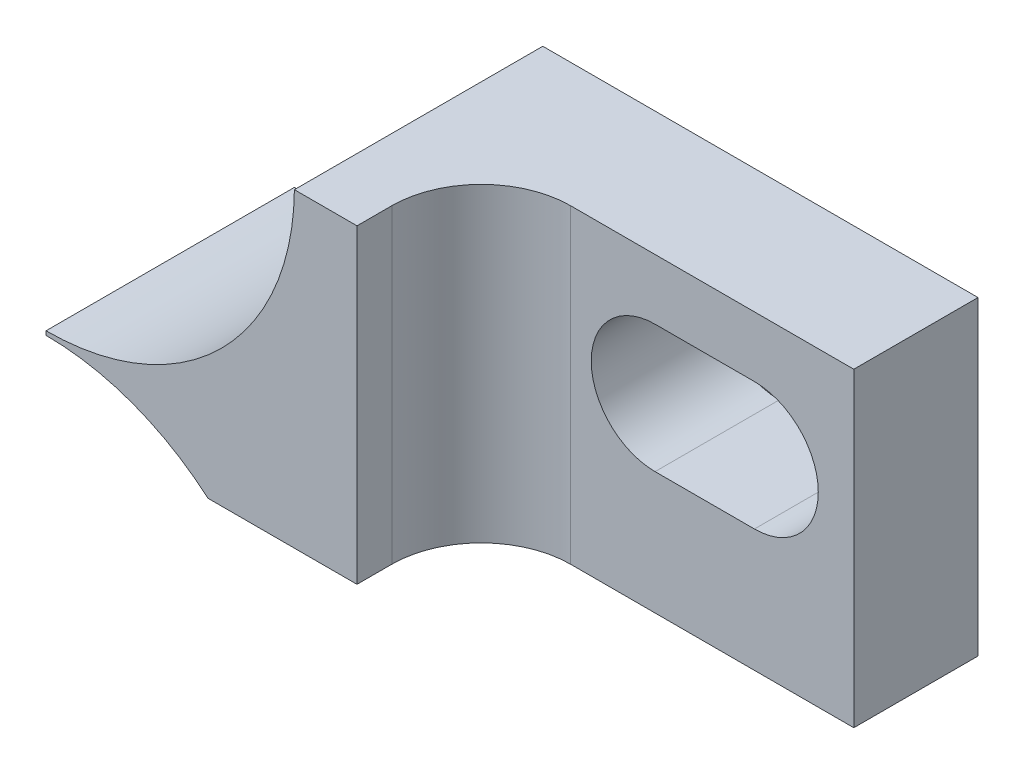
ISO-10303-21;
HEADER;
FILE_DESCRIPTION(('STEP AP214'),'2;1');
FILE_NAME('part.step','',(''),(''),'','','');
FILE_SCHEMA(('AUTOMOTIVE_DESIGN { 1 0 10303 214 1 1 1 1 }'));
ENDSEC;
DATA;
#1=APPLICATION_CONTEXT('core data for automotive mechanical design processes');
#2=APPLICATION_PROTOCOL_DEFINITION('international standard','automotive_design',2000,#1);
#3=PRODUCT_CONTEXT('',#1,'mechanical');
#4=PRODUCT('Part','Part','',(#3));
#5=PRODUCT_RELATED_PRODUCT_CATEGORY('part','',(#4));
#6=PRODUCT_DEFINITION_FORMATION('','',#4);
#7=PRODUCT_DEFINITION_CONTEXT('part definition',#1,'design');
#8=PRODUCT_DEFINITION('design','',#6,#7);
#9=PRODUCT_DEFINITION_SHAPE('','',#8);
#10=(LENGTH_UNIT() NAMED_UNIT(*) SI_UNIT(.MILLI.,.METRE.));
#11=(NAMED_UNIT(*) PLANE_ANGLE_UNIT() SI_UNIT($,.RADIAN.));
#12=(NAMED_UNIT(*) SI_UNIT($,.STERADIAN.) SOLID_ANGLE_UNIT());
#13=UNCERTAINTY_MEASURE_WITH_UNIT(LENGTH_MEASURE(1.E-05),#10,'distance_accuracy_value','');
#14=(GEOMETRIC_REPRESENTATION_CONTEXT(3) GLOBAL_UNCERTAINTY_ASSIGNED_CONTEXT((#13)) GLOBAL_UNIT_ASSIGNED_CONTEXT((#10,
#11,#12)) REPRESENTATION_CONTEXT('',''));
#15=CARTESIAN_POINT('',(0.,0.,0.));
#16=DIRECTION('',(0.,0.,1.));
#17=DIRECTION('',(1.,0.,0.));
#18=AXIS2_PLACEMENT_3D('',#15,#16,#17);
#19=CARTESIAN_POINT('',(96.8248,-0.0508000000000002,6.35));
#20=DIRECTION('',(0.,0.,-1.));
#21=DIRECTION('',(-1.,0.,0.));
#22=AXIS2_PLACEMENT_3D('',#19,#20,#21);
#23=CYLINDRICAL_SURFACE('',#22,6.35);
#24=DIRECTION('',(0.,0.,-1.));
#25=VECTOR('',#24,1.);
#26=CARTESIAN_POINT('',(96.8248,6.2992,6.35));
#27=LINE('',#26,#25);
#28=CARTESIAN_POINT('',(96.8248,6.2992,0.));
#29=VERTEX_POINT('',#28);
#30=CARTESIAN_POINT('',(96.8248,6.2992,6.35));
#31=VERTEX_POINT('',#30);
#32=EDGE_CURVE('E128',#29,#31,#27,.F.);
#33=ORIENTED_EDGE('',*,*,#32,.F.);
#34=CARTESIAN_POINT('',(96.8248,-0.0508000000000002,0.));
#35=DIRECTION('',(0.,0.,-1.));
#36=DIRECTION('',(-1.,0.,0.));
#37=AXIS2_PLACEMENT_3D('',#34,#35,#36);
#38=CIRCLE('',#37,6.35);
#39=CARTESIAN_POINT('',(100.966616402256,4.7625,0.));
#40=VERTEX_POINT('',#39);
#41=EDGE_CURVE('E139',#29,#40,#38,.T.);
#42=ORIENTED_EDGE('',*,*,#41,.T.);
#43=DIRECTION('',(0.,0.,-1.));
#44=VECTOR('',#43,1.);
#45=CARTESIAN_POINT('',(100.966616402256,4.7625,6.35));
#46=LINE('',#45,#44);
#47=CARTESIAN_POINT('',(100.966616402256,4.7625,6.35));
#48=VERTEX_POINT('',#47);
#49=EDGE_CURVE('E148',#40,#48,#46,.F.);
#50=ORIENTED_EDGE('',*,*,#49,.T.);
#51=CARTESIAN_POINT('',(96.8248,-0.0508000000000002,6.35));
#52=DIRECTION('',(0.,0.,-1.));
#53=DIRECTION('',(-1.,0.,0.));
#54=AXIS2_PLACEMENT_3D('',#51,#52,#53);
#55=CIRCLE('',#54,6.35);
#56=EDGE_CURVE('E141',#31,#48,#55,.T.);
#57=ORIENTED_EDGE('',*,*,#56,.F.);
#58=EDGE_LOOP('',(#33,#42,#50,#57));
#59=FACE_BOUND('',#58,.T.);
#60=ADVANCED_FACE('F34',(#59),#23,.F.);
#61=CARTESIAN_POINT('',(96.8248,12.7508,6.35));
#62=DIRECTION('',(0.,0.,-1.));
#63=DIRECTION('',(-1.,0.,0.));
#64=AXIS2_PLACEMENT_3D('',#61,#62,#63);
#65=CYLINDRICAL_SURFACE('',#64,6.35);
#66=DIRECTION('',(0.,0.,-1.));
#67=VECTOR('',#66,1.);
#68=CARTESIAN_POINT('',(96.8248,6.4008,6.35));
#69=LINE('',#68,#67);
#70=CARTESIAN_POINT('',(96.8248,6.4008,6.35));
#71=VERTEX_POINT('',#70);
#72=CARTESIAN_POINT('',(96.8248,6.4008,0.));
#73=VERTEX_POINT('',#72);
#74=EDGE_CURVE('E48',#71,#73,#69,.T.);
#75=ORIENTED_EDGE('',*,*,#74,.F.);
#76=CARTESIAN_POINT('',(96.8248,12.7508,6.35));
#77=DIRECTION('',(0.,0.,-1.));
#78=DIRECTION('',(-1.,0.,0.));
#79=AXIS2_PLACEMENT_3D('',#76,#77,#78);
#80=CIRCLE('',#79,6.35);
#81=CARTESIAN_POINT('',(103.174596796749,12.7,6.35));
#82=VERTEX_POINT('',#81);
#83=EDGE_CURVE('E156',#82,#71,#80,.T.);
#84=ORIENTED_EDGE('',*,*,#83,.F.);
#85=DIRECTION('',(0.,0.,-1.));
#86=VECTOR('',#85,1.);
#87=CARTESIAN_POINT('',(103.174596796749,12.7,6.35));
#88=LINE('',#87,#86);
#89=CARTESIAN_POINT('',(103.174596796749,12.7,0.));
#90=VERTEX_POINT('',#89);
#91=EDGE_CURVE('E183',#82,#90,#88,.T.);
#92=ORIENTED_EDGE('',*,*,#91,.T.);
#93=CARTESIAN_POINT('',(96.8248,12.7508,0.));
#94=DIRECTION('',(0.,0.,-1.));
#95=DIRECTION('',(-1.,0.,0.));
#96=AXIS2_PLACEMENT_3D('',#93,#94,#95);
#97=CIRCLE('',#96,6.35);
#98=EDGE_CURVE('E161',#90,#73,#97,.T.);
#99=ORIENTED_EDGE('',*,*,#98,.T.);
#100=EDGE_LOOP('',(#75,#84,#92,#99));
#101=FACE_BOUND('',#100,.T.);
#102=ADVANCED_FACE('F197',(#101),#65,.F.);
#103=CARTESIAN_POINT('',(-32.4430669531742,6.35000000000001,6.35));
#104=DIRECTION('',(0.,0.,-1.));
#105=DIRECTION('',(-1.,0.,0.));
#106=AXIS2_PLACEMENT_3D('',#103,#104,#105);
#107=PLANE('',#106);
#108=DIRECTION('',(0.,1.,0.));
#109=VECTOR('',#108,1.);
#110=CARTESIAN_POINT('',(96.8248,6.34999999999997,6.35));
#111=LINE('',#110,#109);
#112=EDGE_CURVE('E134',#31,#71,#111,.T.);
#113=ORIENTED_EDGE('',*,*,#112,.F.);
#114=ORIENTED_EDGE('',*,*,#56,.T.);
#115=DIRECTION('',(1.,0.,0.));
#116=VECTOR('',#115,1.);
#117=CARTESIAN_POINT('',(114.3,4.7625,6.35));
#118=LINE('',#117,#116);
#119=CARTESIAN_POINT('',(104.775,4.7625,6.35));
#120=VERTEX_POINT('',#119);
#121=EDGE_CURVE('E210',#48,#120,#118,.T.);
#122=ORIENTED_EDGE('',*,*,#121,.T.);
#123=DIRECTION('',(0.,-1.,0.));
#124=VECTOR('',#123,1.);
#125=CARTESIAN_POINT('',(104.775,12.7,6.35));
#126=LINE('',#125,#124);
#127=CARTESIAN_POINT('',(104.775,12.7,6.35));
#128=VERTEX_POINT('',#127);
#129=EDGE_CURVE('E223',#128,#120,#126,.T.);
#130=ORIENTED_EDGE('',*,*,#129,.F.);
#131=DIRECTION('',(1.,0.,0.));
#132=VECTOR('',#131,1.);
#133=CARTESIAN_POINT('',(-32.4430669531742,12.7,6.35));
#134=LINE('',#133,#132);
#135=EDGE_CURVE('E203',#82,#128,#134,.T.);
#136=ORIENTED_EDGE('',*,*,#135,.F.);
#137=ORIENTED_EDGE('',*,*,#83,.T.);
#138=EDGE_LOOP('',(#113,#114,#122,#130,#136,#137));
#139=FACE_BOUND('',#138,.T.);
#140=ADVANCED_FACE('F242',(#139),#107,.F.);
#141=CARTESIAN_POINT('',(-32.4430669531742,6.35000000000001,0.));
#142=DIRECTION('',(0.,0.,-1.));
#143=DIRECTION('',(-1.,0.,0.));
#144=AXIS2_PLACEMENT_3D('',#141,#142,#143);
#145=PLANE('',#144);
#146=DIRECTION('',(-1.,0.,0.));
#147=VECTOR('',#146,1.);
#148=CARTESIAN_POINT('',(-32.4430669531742,7.89304999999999,0.));
#149=LINE('',#148,#147);
#150=CARTESIAN_POINT('',(111.76,7.89304999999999,0.));
#151=VERTEX_POINT('',#150);
#152=CARTESIAN_POINT('',(109.22,7.89304999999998,0.));
#153=VERTEX_POINT('',#152);
#154=EDGE_CURVE('E163',#151,#153,#149,.T.);
#155=ORIENTED_EDGE('',*,*,#154,.F.);
#156=CARTESIAN_POINT('',(111.76,9.525,0.));
#157=DIRECTION('',(0.,0.,-1.));
#158=DIRECTION('',(-1.,0.,0.));
#159=AXIS2_PLACEMENT_3D('',#156,#157,#158);
#160=CIRCLE('',#159,1.63195);
#161=CARTESIAN_POINT('',(111.76,11.15695,0.));
#162=VERTEX_POINT('',#161);
#163=EDGE_CURVE('E172',#162,#151,#160,.T.);
#164=ORIENTED_EDGE('',*,*,#163,.F.);
#165=DIRECTION('',(1.,0.,0.));
#166=VECTOR('',#165,1.);
#167=CARTESIAN_POINT('',(-32.4430669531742,11.1569499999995,0.));
#168=LINE('',#167,#166);
#169=CARTESIAN_POINT('',(109.22,11.15695,0.));
#170=VERTEX_POINT('',#169);
#171=EDGE_CURVE('E169',#170,#162,#168,.T.);
#172=ORIENTED_EDGE('',*,*,#171,.F.);
#173=CARTESIAN_POINT('',(109.22,9.52499999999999,0.));
#174=DIRECTION('',(0.,0.,-1.));
#175=DIRECTION('',(-1.,0.,0.));
#176=AXIS2_PLACEMENT_3D('',#173,#174,#175);
#177=CIRCLE('',#176,1.63195);
#178=EDGE_CURVE('E166',#153,#170,#177,.T.);
#179=ORIENTED_EDGE('',*,*,#178,.F.);
#180=EDGE_LOOP('',(#155,#164,#172,#179));
#181=FACE_BOUND('',#180,.T.);
#182=ORIENTED_EDGE('',*,*,#41,.F.);
#183=DIRECTION('',(0.,1.,0.));
#184=VECTOR('',#183,1.);
#185=CARTESIAN_POINT('',(96.8248,19.9842856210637,0.));
#186=LINE('',#185,#184);
#187=EDGE_CURVE('E125',#29,#73,#186,.T.);
#188=ORIENTED_EDGE('',*,*,#187,.T.);
#189=ORIENTED_EDGE('',*,*,#98,.F.);
#190=DIRECTION('',(1.,0.,0.));
#191=VECTOR('',#190,1.);
#192=CARTESIAN_POINT('',(-32.4430669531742,12.7,0.));
#193=LINE('',#192,#191);
#194=CARTESIAN_POINT('',(114.3,12.7,0.));
#195=VERTEX_POINT('',#194);
#196=EDGE_CURVE('E151',#90,#195,#193,.T.);
#197=ORIENTED_EDGE('',*,*,#196,.T.);
#198=DIRECTION('',(0.,1.,0.));
#199=VECTOR('',#198,1.);
#200=CARTESIAN_POINT('',(114.3,6.35000000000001,0.));
#201=LINE('',#200,#199);
#202=CARTESIAN_POINT('',(114.3,4.7625,0.));
#203=VERTEX_POINT('',#202);
#204=EDGE_CURVE('E147',#203,#195,#201,.T.);
#205=ORIENTED_EDGE('',*,*,#204,.F.);
#206=DIRECTION('',(1.,0.,0.));
#207=VECTOR('',#206,1.);
#208=CARTESIAN_POINT('',(-32.4430669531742,4.7625,0.));
#209=LINE('',#208,#207);
#210=EDGE_CURVE('E11',#40,#203,#209,.T.);
#211=ORIENTED_EDGE('',*,*,#210,.F.);
#212=EDGE_LOOP('',(#182,#188,#189,#197,#205,#211));
#213=FACE_BOUND('',#212,.T.);
#214=ADVANCED_FACE('F145',(#181,#213),#145,.T.);
#215=CARTESIAN_POINT('',(-32.4430669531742,7.89304999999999,6.35));
#216=DIRECTION('',(0.,-1.,0.));
#217=DIRECTION('',(0.,0.,-1.));
#218=AXIS2_PLACEMENT_3D('',#215,#216,#217);
#219=PLANE('',#218);
#220=DIRECTION('',(0.,0.,-1.));
#221=VECTOR('',#220,1.);
#222=CARTESIAN_POINT('',(109.22,7.89304999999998,6.35));
#223=LINE('',#222,#221);
#224=CARTESIAN_POINT('',(109.22,7.89304999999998,3.175));
#225=VERTEX_POINT('',#224);
#226=EDGE_CURVE('E41',#225,#153,#223,.T.);
#227=ORIENTED_EDGE('',*,*,#226,.F.);
#228=DIRECTION('',(1.,0.,0.));
#229=VECTOR('',#228,1.);
#230=CARTESIAN_POINT('',(-32.4430669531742,7.89304999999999,3.17499999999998));
#231=LINE('',#230,#229);
#232=CARTESIAN_POINT('',(111.76,7.89304999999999,3.175));
#233=VERTEX_POINT('',#232);
#234=EDGE_CURVE('E213',#225,#233,#231,.T.);
#235=ORIENTED_EDGE('',*,*,#234,.T.);
#236=DIRECTION('',(0.,0.,-1.));
#237=VECTOR('',#236,1.);
#238=CARTESIAN_POINT('',(111.76,7.89304999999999,6.35));
#239=LINE('',#238,#237);
#240=EDGE_CURVE('E175',#233,#151,#239,.T.);
#241=ORIENTED_EDGE('',*,*,#240,.T.);
#242=ORIENTED_EDGE('',*,*,#154,.T.);
#243=EDGE_LOOP('',(#227,#235,#241,#242));
#244=FACE_BOUND('',#243,.T.);
#245=ADVANCED_FACE('F274',(#244),#219,.F.);
#246=CARTESIAN_POINT('',(109.22,9.52499999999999,6.35));
#247=DIRECTION('',(0.,0.,-1.));
#248=DIRECTION('',(-1.,0.,0.));
#249=AXIS2_PLACEMENT_3D('',#246,#247,#248);
#250=CYLINDRICAL_SURFACE('',#249,1.63195);
#251=DIRECTION('',(0.,0.,-1.));
#252=VECTOR('',#251,1.);
#253=CARTESIAN_POINT('',(109.22,11.15695,6.35));
#254=LINE('',#253,#252);
#255=CARTESIAN_POINT('',(109.22,11.15695,3.175));
#256=VERTEX_POINT('',#255);
#257=EDGE_CURVE('E180',#256,#170,#254,.T.);
#258=ORIENTED_EDGE('',*,*,#257,.F.);
#259=CARTESIAN_POINT('',(109.22,9.52499999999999,3.175));
#260=DIRECTION('',(0.,0.,-1.));
#261=DIRECTION('',(-1.,0.,0.));
#262=AXIS2_PLACEMENT_3D('',#259,#260,#261);
#263=CIRCLE('',#262,1.63195);
#264=EDGE_CURVE('E216',#256,#225,#263,.F.);
#265=ORIENTED_EDGE('',*,*,#264,.T.);
#266=ORIENTED_EDGE('',*,*,#226,.T.);
#267=ORIENTED_EDGE('',*,*,#178,.T.);
#268=EDGE_LOOP('',(#258,#265,#266,#267));
#269=FACE_BOUND('',#268,.T.);
#270=ADVANCED_FACE('F264',(#269),#250,.F.);
#271=CARTESIAN_POINT('',(-32.4430669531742,11.1569499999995,6.35));
#272=DIRECTION('',(0.,1.,0.));
#273=DIRECTION('',(-1.,0.,0.));
#274=AXIS2_PLACEMENT_3D('',#271,#272,#273);
#275=PLANE('',#274);
#276=DIRECTION('',(0.,0.,-1.));
#277=VECTOR('',#276,1.);
#278=CARTESIAN_POINT('',(111.76,11.15695,6.35));
#279=LINE('',#278,#277);
#280=CARTESIAN_POINT('',(111.76,11.15695,3.175));
#281=VERTEX_POINT('',#280);
#282=EDGE_CURVE('E177',#281,#162,#279,.T.);
#283=ORIENTED_EDGE('',*,*,#282,.F.);
#284=DIRECTION('',(-1.,0.,0.));
#285=VECTOR('',#284,1.);
#286=CARTESIAN_POINT('',(-32.4430669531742,11.1569499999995,3.17499999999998));
#287=LINE('',#286,#285);
#288=EDGE_CURVE('E56',#281,#256,#287,.T.);
#289=ORIENTED_EDGE('',*,*,#288,.T.);
#290=ORIENTED_EDGE('',*,*,#257,.T.);
#291=ORIENTED_EDGE('',*,*,#171,.T.);
#292=EDGE_LOOP('',(#283,#289,#290,#291));
#293=FACE_BOUND('',#292,.T.);
#294=ADVANCED_FACE('F263',(#293),#275,.F.);
#295=CARTESIAN_POINT('',(114.3,6.35000000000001,6.35));
#296=DIRECTION('',(-1.,0.,0.));
#297=DIRECTION('',(0.,0.,1.));
#298=AXIS2_PLACEMENT_3D('',#295,#296,#297);
#299=PLANE('',#298);
#300=DIRECTION('',(0.,0.,-1.));
#301=VECTOR('',#300,1.);
#302=CARTESIAN_POINT('',(114.3,12.7,6.35));
#303=LINE('',#302,#301);
#304=CARTESIAN_POINT('',(114.3,12.7,3.175));
#305=VERTEX_POINT('',#304);
#306=EDGE_CURVE('E178',#305,#195,#303,.T.);
#307=ORIENTED_EDGE('',*,*,#306,.F.);
#308=DIRECTION('',(0.,-1.,0.));
#309=VECTOR('',#308,1.);
#310=CARTESIAN_POINT('',(114.3,12.7,3.175));
#311=LINE('',#310,#309);
#312=CARTESIAN_POINT('',(114.3,4.7625,3.175));
#313=VERTEX_POINT('',#312);
#314=EDGE_CURVE('E222',#305,#313,#311,.T.);
#315=ORIENTED_EDGE('',*,*,#314,.T.);
#316=DIRECTION('',(0.,0.,-1.));
#317=VECTOR('',#316,1.);
#318=CARTESIAN_POINT('',(114.3,4.7625,6.35));
#319=LINE('',#318,#317);
#320=EDGE_CURVE('E153',#313,#203,#319,.T.);
#321=ORIENTED_EDGE('',*,*,#320,.T.);
#322=ORIENTED_EDGE('',*,*,#204,.T.);
#323=EDGE_LOOP('',(#307,#315,#321,#322));
#324=FACE_BOUND('',#323,.T.);
#325=ADVANCED_FACE('F194',(#324),#299,.F.);
#326=CARTESIAN_POINT('',(-32.4430669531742,12.7,6.35));
#327=DIRECTION('',(0.,1.,0.));
#328=DIRECTION('',(0.,0.,1.));
#329=AXIS2_PLACEMENT_3D('',#326,#327,#328);
#330=PLANE('',#329);
#331=DIRECTION('',(1.,0.,0.));
#332=VECTOR('',#331,1.);
#333=CARTESIAN_POINT('',(114.3,12.7,3.175));
#334=LINE('',#333,#332);
#335=CARTESIAN_POINT('',(107.061,12.7,3.175));
#336=VERTEX_POINT('',#335);
#337=EDGE_CURVE('E191',#336,#305,#334,.T.);
#338=ORIENTED_EDGE('',*,*,#337,.T.);
#339=ORIENTED_EDGE('',*,*,#306,.T.);
#340=ORIENTED_EDGE('',*,*,#196,.F.);
#341=ORIENTED_EDGE('',*,*,#91,.F.);
#342=ORIENTED_EDGE('',*,*,#135,.T.);
#343=DIRECTION('',(0.,0.,-1.));
#344=VECTOR('',#343,1.);
#345=CARTESIAN_POINT('',(104.775,12.7,6.35));
#346=LINE('',#345,#344);
#347=CARTESIAN_POINT('',(104.775,12.7,5.461));
#348=VERTEX_POINT('',#347);
#349=EDGE_CURVE('E204',#128,#348,#346,.T.);
#350=ORIENTED_EDGE('',*,*,#349,.T.);
#351=CARTESIAN_POINT('',(107.061,12.7,5.461));
#352=DIRECTION('',(0.,-1.,0.));
#353=DIRECTION('',(0.,0.,1.));
#354=AXIS2_PLACEMENT_3D('',#351,#352,#353);
#355=CIRCLE('',#354,2.286);
#356=EDGE_CURVE('E238',#348,#336,#355,.T.);
#357=ORIENTED_EDGE('',*,*,#356,.T.);
#358=EDGE_LOOP('',(#338,#339,#340,#341,#342,#350,#357));
#359=FACE_BOUND('',#358,.T.);
#360=ADVANCED_FACE('F188',(#359),#330,.T.);
#361=CARTESIAN_POINT('',(111.76,9.525,6.35));
#362=DIRECTION('',(0.,0.,-1.));
#363=DIRECTION('',(-1.,0.,0.));
#364=AXIS2_PLACEMENT_3D('',#361,#362,#363);
#365=CYLINDRICAL_SURFACE('',#364,1.63195);
#366=ORIENTED_EDGE('',*,*,#240,.F.);
#367=CARTESIAN_POINT('',(111.76,9.525,3.175));
#368=DIRECTION('',(0.,0.,-1.));
#369=DIRECTION('',(-1.,0.,0.));
#370=AXIS2_PLACEMENT_3D('',#367,#368,#369);
#371=CIRCLE('',#370,1.63195);
#372=EDGE_CURVE('E220',#233,#281,#371,.F.);
#373=ORIENTED_EDGE('',*,*,#372,.T.);
#374=ORIENTED_EDGE('',*,*,#282,.T.);
#375=ORIENTED_EDGE('',*,*,#163,.T.);
#376=EDGE_LOOP('',(#366,#373,#374,#375));
#377=FACE_BOUND('',#376,.T.);
#378=ADVANCED_FACE('F272',(#377),#365,.F.);
#379=CARTESIAN_POINT('',(114.3,4.7625,6.35));
#380=DIRECTION('',(0.,1.,0.));
#381=DIRECTION('',(0.,0.,1.));
#382=AXIS2_PLACEMENT_3D('',#379,#380,#381);
#383=PLANE('',#382);
#384=ORIENTED_EDGE('',*,*,#320,.F.);
#385=DIRECTION('',(1.,0.,0.));
#386=VECTOR('',#385,1.);
#387=CARTESIAN_POINT('',(114.3,4.7625,3.175));
#388=LINE('',#387,#386);
#389=CARTESIAN_POINT('',(107.061,4.7625,3.175));
#390=VERTEX_POINT('',#389);
#391=EDGE_CURVE('E230',#390,#313,#388,.T.);
#392=ORIENTED_EDGE('',*,*,#391,.F.);
#393=CARTESIAN_POINT('',(107.061,4.7625,5.461));
#394=DIRECTION('',(0.,-1.,0.));
#395=DIRECTION('',(0.,0.,1.));
#396=AXIS2_PLACEMENT_3D('',#393,#394,#395);
#397=CIRCLE('',#396,2.286);
#398=CARTESIAN_POINT('',(104.775,4.7625,5.461));
#399=VERTEX_POINT('',#398);
#400=EDGE_CURVE('E232',#399,#390,#397,.T.);
#401=ORIENTED_EDGE('',*,*,#400,.F.);
#402=DIRECTION('',(0.,0.,-1.));
#403=VECTOR('',#402,1.);
#404=CARTESIAN_POINT('',(104.775,4.7625,6.35));
#405=LINE('',#404,#403);
#406=EDGE_CURVE('E142',#120,#399,#405,.T.);
#407=ORIENTED_EDGE('',*,*,#406,.F.);
#408=ORIENTED_EDGE('',*,*,#121,.F.);
#409=ORIENTED_EDGE('',*,*,#49,.F.);
#410=ORIENTED_EDGE('',*,*,#210,.T.);
#411=EDGE_LOOP('',(#384,#392,#401,#407,#408,#409,#410));
#412=FACE_BOUND('',#411,.T.);
#413=ADVANCED_FACE('F246',(#412),#383,.F.);
#414=CARTESIAN_POINT('',(114.3,12.7,3.175));
#415=DIRECTION('',(0.,0.,-1.));
#416=DIRECTION('',(-1.,0.,0.));
#417=AXIS2_PLACEMENT_3D('',#414,#415,#416);
#418=PLANE('',#417);
#419=ORIENTED_EDGE('',*,*,#391,.T.);
#420=ORIENTED_EDGE('',*,*,#314,.F.);
#421=ORIENTED_EDGE('',*,*,#337,.F.);
#422=DIRECTION('',(0.,-1.,0.));
#423=VECTOR('',#422,1.);
#424=CARTESIAN_POINT('',(107.061,12.7,3.175));
#425=LINE('',#424,#423);
#426=EDGE_CURVE('E227',#336,#390,#425,.T.);
#427=ORIENTED_EDGE('',*,*,#426,.T.);
#428=EDGE_LOOP('',(#419,#420,#421,#427));
#429=FACE_BOUND('',#428,.T.);
#430=ORIENTED_EDGE('',*,*,#264,.F.);
#431=ORIENTED_EDGE('',*,*,#288,.F.);
#432=ORIENTED_EDGE('',*,*,#372,.F.);
#433=ORIENTED_EDGE('',*,*,#234,.F.);
#434=EDGE_LOOP('',(#430,#431,#432,#433));
#435=FACE_BOUND('',#434,.T.);
#436=ADVANCED_FACE('F255',(#429,#435),#418,.F.);
#437=CARTESIAN_POINT('',(107.061,12.7,5.461));
#438=DIRECTION('',(0.,-1.,0.));
#439=DIRECTION('',(0.,0.,-1.));
#440=AXIS2_PLACEMENT_3D('',#437,#438,#439);
#441=CYLINDRICAL_SURFACE('',#440,2.286);
#442=ORIENTED_EDGE('',*,*,#400,.T.);
#443=ORIENTED_EDGE('',*,*,#426,.F.);
#444=ORIENTED_EDGE('',*,*,#356,.F.);
#445=DIRECTION('',(0.,-1.,0.));
#446=VECTOR('',#445,1.);
#447=CARTESIAN_POINT('',(104.775,12.7,5.461));
#448=LINE('',#447,#446);
#449=EDGE_CURVE('E225',#348,#399,#448,.T.);
#450=ORIENTED_EDGE('',*,*,#449,.T.);
#451=EDGE_LOOP('',(#442,#443,#444,#450));
#452=FACE_BOUND('',#451,.T.);
#453=ADVANCED_FACE('F253',(#452),#441,.F.);
#454=CARTESIAN_POINT('',(104.775,12.7,6.35));
#455=DIRECTION('',(-1.,0.,0.));
#456=DIRECTION('',(0.,0.,1.));
#457=AXIS2_PLACEMENT_3D('',#454,#455,#456);
#458=PLANE('',#457);
#459=ORIENTED_EDGE('',*,*,#406,.T.);
#460=ORIENTED_EDGE('',*,*,#449,.F.);
#461=ORIENTED_EDGE('',*,*,#349,.F.);
#462=ORIENTED_EDGE('',*,*,#129,.T.);
#463=EDGE_LOOP('',(#459,#460,#461,#462));
#464=FACE_BOUND('',#463,.T.);
#465=ADVANCED_FACE('F250',(#464),#458,.F.);
#466=CARTESIAN_POINT('',(96.8248,19.9842856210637,8.89));
#467=DIRECTION('',(-1.,0.,0.));
#468=DIRECTION('',(0.,-1.,0.));
#469=AXIS2_PLACEMENT_3D('',#466,#467,#468);
#470=PLANE('',#469);
#471=ORIENTED_EDGE('',*,*,#32,.T.);
#472=ORIENTED_EDGE('',*,*,#112,.T.);
#473=ORIENTED_EDGE('',*,*,#74,.T.);
#474=ORIENTED_EDGE('',*,*,#187,.F.);
#475=EDGE_LOOP('',(#471,#472,#473,#474));
#476=FACE_BOUND('',#475,.T.);
#477=ADVANCED_FACE('F127',(#476),#470,.T.);
#478=CLOSED_SHELL('',(#60,#102,#140,#214,#245,#270,#294,#325,#360,#378,#413,#436,#453,#465,#477));
#479=MANIFOLD_SOLID_BREP('B2',#478);
#480=ADVANCED_BREP_SHAPE_REPRESENTATION('',(#18,#479),#14);
#481=SHAPE_DEFINITION_REPRESENTATION(#9,#480);
ENDSEC;
END-ISO-10303-21;
